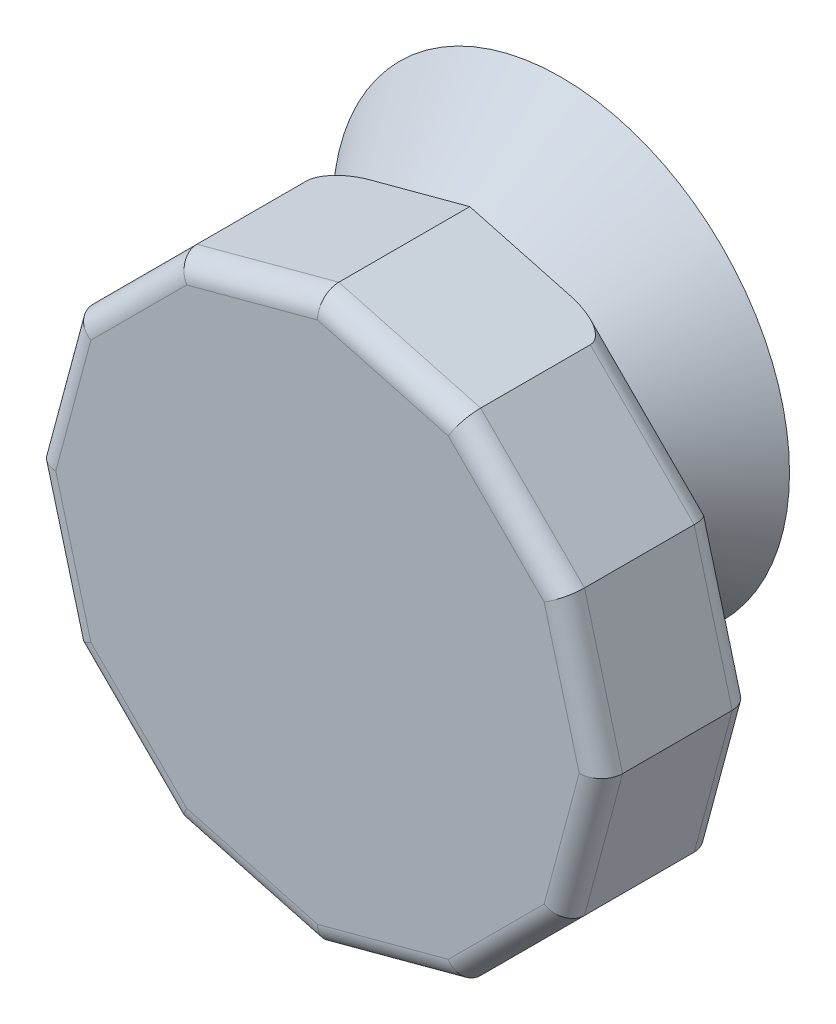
ISO-10303-21;
HEADER;
FILE_DESCRIPTION(('STEP AP214'),'2;1');
FILE_NAME('part.step','',(''),(''),'','','');
FILE_SCHEMA(('AUTOMOTIVE_DESIGN { 1 0 10303 214 1 1 1 1 }'));
ENDSEC;
DATA;
#1=APPLICATION_CONTEXT('core data for automotive mechanical design processes');
#2=APPLICATION_PROTOCOL_DEFINITION('international standard','automotive_design',2000,#1);
#3=PRODUCT_CONTEXT('',#1,'mechanical');
#4=PRODUCT('Part','Part','',(#3));
#5=PRODUCT_RELATED_PRODUCT_CATEGORY('part','',(#4));
#6=PRODUCT_DEFINITION_FORMATION('','',#4);
#7=PRODUCT_DEFINITION_CONTEXT('part definition',#1,'design');
#8=PRODUCT_DEFINITION('design','',#6,#7);
#9=PRODUCT_DEFINITION_SHAPE('','',#8);
#10=(LENGTH_UNIT() NAMED_UNIT(*) SI_UNIT(.MILLI.,.METRE.));
#11=(NAMED_UNIT(*) PLANE_ANGLE_UNIT() SI_UNIT($,.RADIAN.));
#12=(NAMED_UNIT(*) SI_UNIT($,.STERADIAN.) SOLID_ANGLE_UNIT());
#13=UNCERTAINTY_MEASURE_WITH_UNIT(LENGTH_MEASURE(1.E-05),#10,'distance_accuracy_value','');
#14=(GEOMETRIC_REPRESENTATION_CONTEXT(3) GLOBAL_UNCERTAINTY_ASSIGNED_CONTEXT((#13)) GLOBAL_UNIT_ASSIGNED_CONTEXT((#10,
#11,#12)) REPRESENTATION_CONTEXT('',''));
#15=CARTESIAN_POINT('',(0.,0.,0.));
#16=DIRECTION('',(0.,0.,1.));
#17=DIRECTION('',(1.,0.,0.));
#18=AXIS2_PLACEMENT_3D('',#15,#16,#17);
#19=CARTESIAN_POINT('',(-9.31748562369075,0.,5.));
#20=DIRECTION('',(0.965925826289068,0.258819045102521,0.));
#21=DIRECTION('',(-0.258819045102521,0.965925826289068,0.));
#22=AXIS2_PLACEMENT_3D('',#19,#20,#21);
#23=PLANE('',#22);
#24=DIRECTION('',(0.,0.,-1.));
#25=VECTOR('',#24,1.);
#26=CARTESIAN_POINT('',(-8.06917924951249,-4.65874281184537,5.));
#27=LINE('',#26,#25);
#28=CARTESIAN_POINT('',(-8.06917924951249,-4.65874281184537,4.3));
#29=VERTEX_POINT('',#28);
#30=CARTESIAN_POINT('',(-8.06917924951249,-4.65874281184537,0.7));
#31=VERTEX_POINT('',#30);
#32=EDGE_CURVE('E334',#29,#31,#27,.T.);
#33=ORIENTED_EDGE('',*,*,#32,.F.);
#34=DIRECTION('',(0.258819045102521,-0.965925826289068,0.));
#35=VECTOR('',#34,1.);
#36=CARTESIAN_POINT('',(-9.31748562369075,0.,4.3));
#37=LINE('',#36,#35);
#38=CARTESIAN_POINT('',(-9.31748562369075,0.,4.3));
#39=VERTEX_POINT('',#38);
#40=EDGE_CURVE('E542',#29,#39,#37,.F.);
#41=ORIENTED_EDGE('',*,*,#40,.T.);
#42=DIRECTION('',(0.,0.,-1.));
#43=VECTOR('',#42,1.);
#44=CARTESIAN_POINT('',(-9.31748562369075,0.,5.));
#45=LINE('',#44,#43);
#46=CARTESIAN_POINT('',(-9.31748562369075,0.,0.7));
#47=VERTEX_POINT('',#46);
#48=EDGE_CURVE('E345',#39,#47,#45,.T.);
#49=ORIENTED_EDGE('',*,*,#48,.T.);
#50=DIRECTION('',(0.258819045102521,-0.965925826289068,0.));
#51=VECTOR('',#50,1.);
#52=CARTESIAN_POINT('',(-9.31748562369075,0.,0.7));
#53=LINE('',#52,#51);
#54=EDGE_CURVE('E539',#47,#31,#53,.T.);
#55=ORIENTED_EDGE('',*,*,#54,.T.);
#56=EDGE_LOOP('',(#33,#41,#49,#55));
#57=FACE_BOUND('',#56,.T.);
#58=ADVANCED_FACE('F47',(#57),#23,.F.);
#59=CARTESIAN_POINT('',(-8.06917924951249,-4.65874281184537,5.));
#60=DIRECTION('',(0.707106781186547,0.707106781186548,0.));
#61=DIRECTION('',(-0.707106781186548,0.707106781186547,0.));
#62=AXIS2_PLACEMENT_3D('',#59,#60,#61);
#63=PLANE('',#62);
#64=DIRECTION('',(0.,0.,-1.));
#65=VECTOR('',#64,1.);
#66=CARTESIAN_POINT('',(-4.65874281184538,-8.06917924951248,5.));
#67=LINE('',#66,#65);
#68=CARTESIAN_POINT('',(-4.65874281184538,-8.06917924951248,4.3));
#69=VERTEX_POINT('',#68);
#70=CARTESIAN_POINT('',(-4.65874281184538,-8.06917924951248,0.7));
#71=VERTEX_POINT('',#70);
#72=EDGE_CURVE('E385',#69,#71,#67,.T.);
#73=ORIENTED_EDGE('',*,*,#72,.F.);
#74=DIRECTION('',(0.707106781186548,-0.707106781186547,0.));
#75=VECTOR('',#74,1.);
#76=CARTESIAN_POINT('',(-8.06917924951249,-4.65874281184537,4.3));
#77=LINE('',#76,#75);
#78=EDGE_CURVE('E536',#69,#29,#77,.F.);
#79=ORIENTED_EDGE('',*,*,#78,.T.);
#80=ORIENTED_EDGE('',*,*,#32,.T.);
#81=DIRECTION('',(0.707106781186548,-0.707106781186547,0.));
#82=VECTOR('',#81,1.);
#83=CARTESIAN_POINT('',(-8.06917924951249,-4.65874281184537,0.7));
#84=LINE('',#83,#82);
#85=EDGE_CURVE('E533',#31,#71,#84,.T.);
#86=ORIENTED_EDGE('',*,*,#85,.T.);
#87=EDGE_LOOP('',(#73,#79,#80,#86));
#88=FACE_BOUND('',#87,.T.);
#89=ADVANCED_FACE('F731',(#88),#63,.F.);
#90=CARTESIAN_POINT('',(-4.65874281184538,-8.06917924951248,5.));
#91=DIRECTION('',(0.258819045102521,0.965925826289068,0.));
#92=DIRECTION('',(-0.965925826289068,0.258819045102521,0.));
#93=AXIS2_PLACEMENT_3D('',#90,#91,#92);
#94=PLANE('',#93);
#95=DIRECTION('',(0.,0.,-1.));
#96=VECTOR('',#95,1.);
#97=CARTESIAN_POINT('',(0.,-9.31748562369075,5.));
#98=LINE('',#97,#96);
#99=CARTESIAN_POINT('',(0.,-9.31748562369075,4.3));
#100=VERTEX_POINT('',#99);
#101=CARTESIAN_POINT('',(0.,-9.31748562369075,0.7));
#102=VERTEX_POINT('',#101);
#103=EDGE_CURVE('E381',#100,#102,#98,.T.);
#104=ORIENTED_EDGE('',*,*,#103,.F.);
#105=DIRECTION('',(0.965925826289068,-0.258819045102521,0.));
#106=VECTOR('',#105,1.);
#107=CARTESIAN_POINT('',(-4.65874281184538,-8.06917924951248,4.3));
#108=LINE('',#107,#106);
#109=EDGE_CURVE('E530',#100,#69,#108,.F.);
#110=ORIENTED_EDGE('',*,*,#109,.T.);
#111=ORIENTED_EDGE('',*,*,#72,.T.);
#112=DIRECTION('',(0.965925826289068,-0.258819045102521,0.));
#113=VECTOR('',#112,1.);
#114=CARTESIAN_POINT('',(-4.65874281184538,-8.06917924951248,0.7));
#115=LINE('',#114,#113);
#116=EDGE_CURVE('E527',#71,#102,#115,.T.);
#117=ORIENTED_EDGE('',*,*,#116,.T.);
#118=EDGE_LOOP('',(#104,#110,#111,#117));
#119=FACE_BOUND('',#118,.T.);
#120=ADVANCED_FACE('F738',(#119),#94,.F.);
#121=CARTESIAN_POINT('',(0.,-9.31748562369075,5.));
#122=DIRECTION('',(-0.25881904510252,0.965925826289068,0.));
#123=DIRECTION('',(-0.965925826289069,-0.25881904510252,0.));
#124=AXIS2_PLACEMENT_3D('',#121,#122,#123);
#125=PLANE('',#124);
#126=DIRECTION('',(0.,0.,-1.));
#127=VECTOR('',#126,1.);
#128=CARTESIAN_POINT('',(4.65874281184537,-8.06917924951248,5.));
#129=LINE('',#128,#127);
#130=CARTESIAN_POINT('',(4.65874281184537,-8.06917924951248,4.3));
#131=VERTEX_POINT('',#130);
#132=CARTESIAN_POINT('',(4.65874281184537,-8.06917924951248,0.7));
#133=VERTEX_POINT('',#132);
#134=EDGE_CURVE('E377',#131,#133,#129,.T.);
#135=ORIENTED_EDGE('',*,*,#134,.F.);
#136=DIRECTION('',(0.965925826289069,0.25881904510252,0.));
#137=VECTOR('',#136,1.);
#138=CARTESIAN_POINT('',(0.,-9.31748562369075,4.3));
#139=LINE('',#138,#137);
#140=EDGE_CURVE('E524',#131,#100,#139,.F.);
#141=ORIENTED_EDGE('',*,*,#140,.T.);
#142=ORIENTED_EDGE('',*,*,#103,.T.);
#143=DIRECTION('',(0.965925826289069,0.25881904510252,0.));
#144=VECTOR('',#143,1.);
#145=CARTESIAN_POINT('',(0.,-9.31748562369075,0.7));
#146=LINE('',#145,#144);
#147=EDGE_CURVE('E521',#102,#133,#146,.T.);
#148=ORIENTED_EDGE('',*,*,#147,.T.);
#149=EDGE_LOOP('',(#135,#141,#142,#148));
#150=FACE_BOUND('',#149,.T.);
#151=ADVANCED_FACE('F1040',(#150),#125,.F.);
#152=CARTESIAN_POINT('',(4.65874281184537,-8.06917924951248,5.));
#153=DIRECTION('',(-0.707106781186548,0.707106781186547,0.));
#154=DIRECTION('',(-0.707106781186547,-0.707106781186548,0.));
#155=AXIS2_PLACEMENT_3D('',#152,#153,#154);
#156=PLANE('',#155);
#157=DIRECTION('',(0.,0.,-1.));
#158=VECTOR('',#157,1.);
#159=CARTESIAN_POINT('',(8.06917924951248,-4.65874281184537,5.));
#160=LINE('',#159,#158);
#161=CARTESIAN_POINT('',(8.06917924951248,-4.65874281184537,4.3));
#162=VERTEX_POINT('',#161);
#163=CARTESIAN_POINT('',(8.06917924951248,-4.65874281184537,0.7));
#164=VERTEX_POINT('',#163);
#165=EDGE_CURVE('E373',#162,#164,#160,.T.);
#166=ORIENTED_EDGE('',*,*,#165,.F.);
#167=DIRECTION('',(0.707106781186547,0.707106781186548,0.));
#168=VECTOR('',#167,1.);
#169=CARTESIAN_POINT('',(4.65874281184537,-8.06917924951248,4.3));
#170=LINE('',#169,#168);
#171=EDGE_CURVE('E518',#162,#131,#170,.F.);
#172=ORIENTED_EDGE('',*,*,#171,.T.);
#173=ORIENTED_EDGE('',*,*,#134,.T.);
#174=DIRECTION('',(0.707106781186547,0.707106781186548,0.));
#175=VECTOR('',#174,1.);
#176=CARTESIAN_POINT('',(4.65874281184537,-8.06917924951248,0.7));
#177=LINE('',#176,#175);
#178=EDGE_CURVE('E515',#133,#164,#177,.T.);
#179=ORIENTED_EDGE('',*,*,#178,.T.);
#180=EDGE_LOOP('',(#166,#172,#173,#179));
#181=FACE_BOUND('',#180,.T.);
#182=ADVANCED_FACE('F706',(#181),#156,.F.);
#183=CARTESIAN_POINT('',(8.06917924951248,-4.65874281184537,5.));
#184=DIRECTION('',(-0.965925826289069,0.25881904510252,0.));
#185=DIRECTION('',(-0.25881904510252,-0.965925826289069,0.));
#186=AXIS2_PLACEMENT_3D('',#183,#184,#185);
#187=PLANE('',#186);
#188=DIRECTION('',(0.,0.,-1.));
#189=VECTOR('',#188,1.);
#190=CARTESIAN_POINT('',(9.31748562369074,0.,5.));
#191=LINE('',#190,#189);
#192=CARTESIAN_POINT('',(9.31748562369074,0.,4.3));
#193=VERTEX_POINT('',#192);
#194=CARTESIAN_POINT('',(9.31748562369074,0.,0.7));
#195=VERTEX_POINT('',#194);
#196=EDGE_CURVE('E369',#193,#195,#191,.T.);
#197=ORIENTED_EDGE('',*,*,#196,.F.);
#198=DIRECTION('',(0.25881904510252,0.965925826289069,0.));
#199=VECTOR('',#198,1.);
#200=CARTESIAN_POINT('',(8.06917924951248,-4.65874281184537,4.3));
#201=LINE('',#200,#199);
#202=EDGE_CURVE('E512',#193,#162,#201,.F.);
#203=ORIENTED_EDGE('',*,*,#202,.T.);
#204=ORIENTED_EDGE('',*,*,#165,.T.);
#205=DIRECTION('',(0.25881904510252,0.965925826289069,0.));
#206=VECTOR('',#205,1.);
#207=CARTESIAN_POINT('',(8.06917924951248,-4.65874281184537,0.7));
#208=LINE('',#207,#206);
#209=EDGE_CURVE('E509',#164,#195,#208,.T.);
#210=ORIENTED_EDGE('',*,*,#209,.T.);
#211=EDGE_LOOP('',(#197,#203,#204,#210));
#212=FACE_BOUND('',#211,.T.);
#213=ADVANCED_FACE('F704',(#212),#187,.F.);
#214=CARTESIAN_POINT('',(9.31748562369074,0.,5.));
#215=DIRECTION('',(-0.965925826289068,-0.258819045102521,0.));
#216=DIRECTION('',(0.258819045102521,-0.965925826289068,0.));
#217=AXIS2_PLACEMENT_3D('',#214,#215,#216);
#218=PLANE('',#217);
#219=DIRECTION('',(0.,0.,-1.));
#220=VECTOR('',#219,1.);
#221=CARTESIAN_POINT('',(8.06917924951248,4.65874281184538,5.));
#222=LINE('',#221,#220);
#223=CARTESIAN_POINT('',(8.06917924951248,4.65874281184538,4.3));
#224=VERTEX_POINT('',#223);
#225=CARTESIAN_POINT('',(8.06917924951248,4.65874281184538,0.7));
#226=VERTEX_POINT('',#225);
#227=EDGE_CURVE('E365',#224,#226,#222,.T.);
#228=ORIENTED_EDGE('',*,*,#227,.F.);
#229=DIRECTION('',(-0.258819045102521,0.965925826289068,0.));
#230=VECTOR('',#229,1.);
#231=CARTESIAN_POINT('',(9.31748562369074,0.,4.3));
#232=LINE('',#231,#230);
#233=EDGE_CURVE('E506',#224,#193,#232,.F.);
#234=ORIENTED_EDGE('',*,*,#233,.T.);
#235=ORIENTED_EDGE('',*,*,#196,.T.);
#236=DIRECTION('',(-0.258819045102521,0.965925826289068,0.));
#237=VECTOR('',#236,1.);
#238=CARTESIAN_POINT('',(9.31748562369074,0.,0.7));
#239=LINE('',#238,#237);
#240=EDGE_CURVE('E503',#195,#226,#239,.T.);
#241=ORIENTED_EDGE('',*,*,#240,.T.);
#242=EDGE_LOOP('',(#228,#234,#235,#241));
#243=FACE_BOUND('',#242,.T.);
#244=ADVANCED_FACE('F691',(#243),#218,.F.);
#245=CARTESIAN_POINT('',(8.06917924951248,4.65874281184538,5.));
#246=DIRECTION('',(-0.707106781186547,-0.707106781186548,0.));
#247=DIRECTION('',(0.707106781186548,-0.707106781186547,0.));
#248=AXIS2_PLACEMENT_3D('',#245,#246,#247);
#249=PLANE('',#248);
#250=DIRECTION('',(0.,0.,-1.));
#251=VECTOR('',#250,1.);
#252=CARTESIAN_POINT('',(4.65874281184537,8.06917924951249,5.));
#253=LINE('',#252,#251);
#254=CARTESIAN_POINT('',(4.65874281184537,8.06917924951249,4.3));
#255=VERTEX_POINT('',#254);
#256=CARTESIAN_POINT('',(4.65874281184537,8.06917924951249,0.7));
#257=VERTEX_POINT('',#256);
#258=EDGE_CURVE('E361',#255,#257,#253,.T.);
#259=ORIENTED_EDGE('',*,*,#258,.F.);
#260=DIRECTION('',(-0.707106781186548,0.707106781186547,0.));
#261=VECTOR('',#260,1.);
#262=CARTESIAN_POINT('',(8.06917924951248,4.65874281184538,4.3));
#263=LINE('',#262,#261);
#264=EDGE_CURVE('E500',#255,#224,#263,.F.);
#265=ORIENTED_EDGE('',*,*,#264,.T.);
#266=ORIENTED_EDGE('',*,*,#227,.T.);
#267=DIRECTION('',(-0.707106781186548,0.707106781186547,0.));
#268=VECTOR('',#267,1.);
#269=CARTESIAN_POINT('',(8.06917924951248,4.65874281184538,0.7));
#270=LINE('',#269,#268);
#271=EDGE_CURVE('E497',#226,#257,#270,.T.);
#272=ORIENTED_EDGE('',*,*,#271,.T.);
#273=EDGE_LOOP('',(#259,#265,#266,#272));
#274=FACE_BOUND('',#273,.T.);
#275=ADVANCED_FACE('F662',(#274),#249,.F.);
#276=CARTESIAN_POINT('',(4.65874281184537,8.06917924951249,5.));
#277=DIRECTION('',(-0.25881904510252,-0.965925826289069,0.));
#278=DIRECTION('',(0.965925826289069,-0.25881904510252,0.));
#279=AXIS2_PLACEMENT_3D('',#276,#277,#278);
#280=PLANE('',#279);
#281=DIRECTION('',(0.,0.,-1.));
#282=VECTOR('',#281,1.);
#283=CARTESIAN_POINT('',(0.,9.31748562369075,5.));
#284=LINE('',#283,#282);
#285=CARTESIAN_POINT('',(0.,9.31748562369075,4.3));
#286=VERTEX_POINT('',#285);
#287=CARTESIAN_POINT('',(0.,9.31748562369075,0.));
#288=VERTEX_POINT('',#287);
#289=EDGE_CURVE('E357',#286,#288,#284,.T.);
#290=ORIENTED_EDGE('',*,*,#289,.F.);
#291=DIRECTION('',(-0.965925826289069,0.25881904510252,0.));
#292=VECTOR('',#291,1.);
#293=CARTESIAN_POINT('',(4.65874281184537,8.06917924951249,4.3));
#294=LINE('',#293,#292);
#295=EDGE_CURVE('E494',#286,#255,#294,.F.);
#296=ORIENTED_EDGE('',*,*,#295,.T.);
#297=ORIENTED_EDGE('',*,*,#258,.T.);
#298=CARTESIAN_POINT('',(3.30644665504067,8.43152591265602,0.7));
#299=DIRECTION('',(-0.25881904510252,-0.965925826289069,0.));
#300=DIRECTION('',(-0.965925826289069,0.25881904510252,0.));
#301=AXIS2_PLACEMENT_3D('',#298,#299,#300);
#302=ELLIPSE('',#301,1.4,0.7);
#303=CARTESIAN_POINT('',(3.30644665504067,8.43152591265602,0.));
#304=VERTEX_POINT('',#303);
#305=EDGE_CURVE('E491',#257,#304,#302,.F.);
#306=ORIENTED_EDGE('',*,*,#305,.T.);
#307=DIRECTION('',(-0.965925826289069,0.25881904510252,0.));
#308=VECTOR('',#307,1.);
#309=CARTESIAN_POINT('',(4.65874281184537,8.06917924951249,0.));
#310=LINE('',#309,#308);
#311=EDGE_CURVE('E338',#304,#288,#310,.T.);
#312=ORIENTED_EDGE('',*,*,#311,.T.);
#313=EDGE_LOOP('',(#290,#296,#297,#306,#312));
#314=FACE_BOUND('',#313,.T.);
#315=ADVANCED_FACE('F667',(#314),#280,.F.);
#316=CARTESIAN_POINT('',(0.,9.31748562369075,5.));
#317=DIRECTION('',(0.258819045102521,-0.965925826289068,0.));
#318=DIRECTION('',(0.965925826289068,0.258819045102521,0.));
#319=AXIS2_PLACEMENT_3D('',#316,#317,#318);
#320=PLANE('',#319);
#321=DIRECTION('',(0.,0.,-1.));
#322=VECTOR('',#321,1.);
#323=CARTESIAN_POINT('',(-4.65874281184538,8.06917924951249,5.));
#324=LINE('',#323,#322);
#325=CARTESIAN_POINT('',(-4.65874281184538,8.06917924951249,4.3));
#326=VERTEX_POINT('',#325);
#327=CARTESIAN_POINT('',(-4.65874281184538,8.06917924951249,0.7));
#328=VERTEX_POINT('',#327);
#329=EDGE_CURVE('E353',#326,#328,#324,.T.);
#330=ORIENTED_EDGE('',*,*,#329,.F.);
#331=DIRECTION('',(-0.965925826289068,-0.258819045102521,0.));
#332=VECTOR('',#331,1.);
#333=CARTESIAN_POINT('',(0.,9.31748562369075,4.3));
#334=LINE('',#333,#332);
#335=EDGE_CURVE('E488',#326,#286,#334,.F.);
#336=ORIENTED_EDGE('',*,*,#335,.T.);
#337=ORIENTED_EDGE('',*,*,#289,.T.);
#338=DIRECTION('',(-0.965925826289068,-0.258819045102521,0.));
#339=VECTOR('',#338,1.);
#340=CARTESIAN_POINT('',(0.,9.31748562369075,0.));
#341=LINE('',#340,#339);
#342=CARTESIAN_POINT('',(-3.30644665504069,8.43152591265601,0.));
#343=VERTEX_POINT('',#342);
#344=EDGE_CURVE('E341',#288,#343,#341,.T.);
#345=ORIENTED_EDGE('',*,*,#344,.T.);
#346=CARTESIAN_POINT('',(-3.30644665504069,8.43152591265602,0.7));
#347=DIRECTION('',(0.258819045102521,-0.965925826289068,0.));
#348=DIRECTION('',(-0.965925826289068,-0.258819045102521,0.));
#349=AXIS2_PLACEMENT_3D('',#346,#347,#348);
#350=ELLIPSE('',#349,1.4,0.7);
#351=EDGE_CURVE('E485',#343,#328,#350,.F.);
#352=ORIENTED_EDGE('',*,*,#351,.T.);
#353=EDGE_LOOP('',(#330,#336,#337,#345,#352));
#354=FACE_BOUND('',#353,.T.);
#355=ADVANCED_FACE('F995',(#354),#320,.F.);
#356=CARTESIAN_POINT('',(-4.65874281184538,8.06917924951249,5.));
#357=DIRECTION('',(0.707106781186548,-0.707106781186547,0.));
#358=DIRECTION('',(0.707106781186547,0.707106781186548,0.));
#359=AXIS2_PLACEMENT_3D('',#356,#357,#358);
#360=PLANE('',#359);
#361=DIRECTION('',(0.,0.,-1.));
#362=VECTOR('',#361,1.);
#363=CARTESIAN_POINT('',(-8.06917924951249,4.65874281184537,5.));
#364=LINE('',#363,#362);
#365=CARTESIAN_POINT('',(-8.06917924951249,4.65874281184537,4.3));
#366=VERTEX_POINT('',#365);
#367=CARTESIAN_POINT('',(-8.06917924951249,4.65874281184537,0.7));
#368=VERTEX_POINT('',#367);
#369=EDGE_CURVE('E349',#366,#368,#364,.T.);
#370=ORIENTED_EDGE('',*,*,#369,.F.);
#371=DIRECTION('',(-0.707106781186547,-0.707106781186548,0.));
#372=VECTOR('',#371,1.);
#373=CARTESIAN_POINT('',(-4.65874281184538,8.06917924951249,4.3));
#374=LINE('',#373,#372);
#375=EDGE_CURVE('E482',#366,#326,#374,.F.);
#376=ORIENTED_EDGE('',*,*,#375,.T.);
#377=ORIENTED_EDGE('',*,*,#329,.T.);
#378=DIRECTION('',(-0.707106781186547,-0.707106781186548,0.));
#379=VECTOR('',#378,1.);
#380=CARTESIAN_POINT('',(-4.65874281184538,8.06917924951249,0.7));
#381=LINE('',#380,#379);
#382=EDGE_CURVE('E478',#328,#368,#381,.T.);
#383=ORIENTED_EDGE('',*,*,#382,.T.);
#384=EDGE_LOOP('',(#370,#376,#377,#383));
#385=FACE_BOUND('',#384,.T.);
#386=ADVANCED_FACE('F986',(#385),#360,.F.);
#387=CARTESIAN_POINT('',(-8.06917924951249,4.65874281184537,5.));
#388=DIRECTION('',(0.965925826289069,-0.25881904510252,0.));
#389=DIRECTION('',(0.25881904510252,0.965925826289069,0.));
#390=AXIS2_PLACEMENT_3D('',#387,#388,#389);
#391=PLANE('',#390);
#392=ORIENTED_EDGE('',*,*,#48,.F.);
#393=DIRECTION('',(-0.25881904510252,-0.965925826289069,0.));
#394=VECTOR('',#393,1.);
#395=CARTESIAN_POINT('',(-8.06917924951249,4.65874281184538,4.3));
#396=LINE('',#395,#394);
#397=EDGE_CURVE('E474',#39,#366,#396,.F.);
#398=ORIENTED_EDGE('',*,*,#397,.T.);
#399=ORIENTED_EDGE('',*,*,#369,.T.);
#400=DIRECTION('',(-0.25881904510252,-0.965925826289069,0.));
#401=VECTOR('',#400,1.);
#402=CARTESIAN_POINT('',(-8.06917924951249,4.65874281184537,0.7));
#403=LINE('',#402,#401);
#404=EDGE_CURVE('E471',#368,#47,#403,.T.);
#405=ORIENTED_EDGE('',*,*,#404,.T.);
#406=EDGE_LOOP('',(#392,#398,#399,#405));
#407=FACE_BOUND('',#406,.T.);
#408=ADVANCED_FACE('F978',(#407),#391,.F.);
#409=CARTESIAN_POINT('',(0.,0.,5.));
#410=DIRECTION('',(0.,0.,1.));
#411=DIRECTION('',(1.,0.,0.));
#412=AXIS2_PLACEMENT_3D('',#409,#410,#411);
#413=PLANE('',#412);
#414=DIRECTION('',(-0.707106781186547,-0.707106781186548,0.));
#415=VECTOR('',#414,1.);
#416=CARTESIAN_POINT('',(-7.57420450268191,4.16376806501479,5.));
#417=LINE('',#416,#415);
#418=CARTESIAN_POINT('',(-4.29639614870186,7.44157641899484,5.));
#419=VERTEX_POINT('',#418);
#420=CARTESIAN_POINT('',(-7.44157641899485,4.29639614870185,5.));
#421=VERTEX_POINT('',#420);
#422=EDGE_CURVE('E464',#419,#421,#417,.T.);
#423=ORIENTED_EDGE('',*,*,#422,.T.);
#424=DIRECTION('',(-0.25881904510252,-0.965925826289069,0.));
#425=VECTOR('',#424,1.);
#426=CARTESIAN_POINT('',(-8.6413375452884,-0.181173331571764,5.));
#427=LINE('',#426,#425);
#428=CARTESIAN_POINT('',(-8.59279229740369,0.,5.));
#429=VERTEX_POINT('',#428);
#430=EDGE_CURVE('E467',#421,#429,#427,.T.);
#431=ORIENTED_EDGE('',*,*,#430,.T.);
#432=DIRECTION('',(0.258819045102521,-0.965925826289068,0.));
#433=VECTOR('',#432,1.);
#434=CARTESIAN_POINT('',(-7.39303117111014,-4.47756948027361,5.));
#435=LINE('',#434,#433);
#436=CARTESIAN_POINT('',(-7.44157641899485,-4.29639614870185,5.));
#437=VERTEX_POINT('',#436);
#438=EDGE_CURVE('E434',#429,#437,#435,.T.);
#439=ORIENTED_EDGE('',*,*,#438,.T.);
#440=DIRECTION('',(0.707106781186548,-0.707106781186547,0.));
#441=VECTOR('',#440,1.);
#442=CARTESIAN_POINT('',(-4.16376806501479,-7.5742045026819,5.));
#443=LINE('',#442,#441);
#444=CARTESIAN_POINT('',(-4.29639614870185,-7.44157641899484,5.));
#445=VERTEX_POINT('',#444);
#446=EDGE_CURVE('E437',#437,#445,#443,.T.);
#447=ORIENTED_EDGE('',*,*,#446,.T.);
#448=DIRECTION('',(0.965925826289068,-0.258819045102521,0.));
#449=VECTOR('',#448,1.);
#450=CARTESIAN_POINT('',(0.181173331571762,-8.6413375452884,5.));
#451=LINE('',#450,#449);
#452=CARTESIAN_POINT('',(0.,-8.59279229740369,5.));
#453=VERTEX_POINT('',#452);
#454=EDGE_CURVE('E440',#445,#453,#451,.T.);
#455=ORIENTED_EDGE('',*,*,#454,.T.);
#456=DIRECTION('',(0.965925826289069,0.25881904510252,0.));
#457=VECTOR('',#456,1.);
#458=CARTESIAN_POINT('',(4.47756948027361,-7.39303117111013,5.));
#459=LINE('',#458,#457);
#460=CARTESIAN_POINT('',(4.29639614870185,-7.44157641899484,5.));
#461=VERTEX_POINT('',#460);
#462=EDGE_CURVE('E443',#453,#461,#459,.T.);
#463=ORIENTED_EDGE('',*,*,#462,.T.);
#464=DIRECTION('',(0.707106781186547,0.707106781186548,0.));
#465=VECTOR('',#464,1.);
#466=CARTESIAN_POINT('',(7.5742045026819,-4.16376806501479,5.));
#467=LINE('',#466,#465);
#468=CARTESIAN_POINT('',(7.44157641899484,-4.29639614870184,5.));
#469=VERTEX_POINT('',#468);
#470=EDGE_CURVE('E446',#461,#469,#467,.T.);
#471=ORIENTED_EDGE('',*,*,#470,.T.);
#472=DIRECTION('',(0.25881904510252,0.965925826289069,0.));
#473=VECTOR('',#472,1.);
#474=CARTESIAN_POINT('',(8.6413375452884,0.181173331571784,5.));
#475=LINE('',#474,#473);
#476=CARTESIAN_POINT('',(8.59279229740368,0.,5.));
#477=VERTEX_POINT('',#476);
#478=EDGE_CURVE('E449',#469,#477,#475,.T.);
#479=ORIENTED_EDGE('',*,*,#478,.T.);
#480=DIRECTION('',(-0.258819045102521,0.965925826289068,0.));
#481=VECTOR('',#480,1.);
#482=CARTESIAN_POINT('',(7.39303117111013,4.47756948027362,5.));
#483=LINE('',#482,#481);
#484=CARTESIAN_POINT('',(7.44157641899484,4.29639614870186,5.));
#485=VERTEX_POINT('',#484);
#486=EDGE_CURVE('E452',#477,#485,#483,.T.);
#487=ORIENTED_EDGE('',*,*,#486,.T.);
#488=DIRECTION('',(-0.707106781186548,0.707106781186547,0.));
#489=VECTOR('',#488,1.);
#490=CARTESIAN_POINT('',(4.16376806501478,7.57420450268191,5.));
#491=LINE('',#490,#489);
#492=CARTESIAN_POINT('',(4.29639614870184,7.44157641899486,5.));
#493=VERTEX_POINT('',#492);
#494=EDGE_CURVE('E455',#485,#493,#491,.T.);
#495=ORIENTED_EDGE('',*,*,#494,.T.);
#496=DIRECTION('',(-0.965925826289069,0.25881904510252,0.));
#497=VECTOR('',#496,1.);
#498=CARTESIAN_POINT('',(-0.181173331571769,8.64133754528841,5.));
#499=LINE('',#498,#497);
#500=CARTESIAN_POINT('',(0.,8.5927922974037,5.));
#501=VERTEX_POINT('',#500);
#502=EDGE_CURVE('E458',#493,#501,#499,.T.);
#503=ORIENTED_EDGE('',*,*,#502,.T.);
#504=DIRECTION('',(-0.965925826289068,-0.258819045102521,0.));
#505=VECTOR('',#504,1.);
#506=CARTESIAN_POINT('',(-4.47756948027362,7.39303117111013,5.));
#507=LINE('',#506,#505);
#508=EDGE_CURVE('E461',#501,#419,#507,.T.);
#509=ORIENTED_EDGE('',*,*,#508,.T.);
#510=EDGE_LOOP('',(#423,#431,#439,#447,#455,#463,#471,#479,#487,#495,#503,#509));
#511=FACE_BOUND('',#510,.T.);
#512=ADVANCED_FACE('F682',(#511),#413,.T.);
#513=CARTESIAN_POINT('',(0.,0.,0.));
#514=DIRECTION('',(0.,0.,1.));
#515=DIRECTION('',(1.,0.,0.));
#516=AXIS2_PLACEMENT_3D('',#513,#514,#515);
#517=PLANE('',#516);
#518=CARTESIAN_POINT('',(0.,4.00000000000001,0.));
#519=DIRECTION('',(0.,0.,-1.));
#520=DIRECTION('',(-1.,0.,0.));
#521=AXIS2_PLACEMENT_3D('',#518,#519,#520);
#522=CIRCLE('',#521,5.);
#523=CARTESIAN_POINT('',(-4.4710190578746,1.76169962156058,0.));
#524=VERTEX_POINT('',#523);
#525=CARTESIAN_POINT('',(4.4710190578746,1.76169962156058,0.));
#526=VERTEX_POINT('',#525);
#527=EDGE_CURVE('E329',#524,#526,#522,.T.);
#528=ORIENTED_EDGE('',*,*,#527,.F.);
#529=DIRECTION('',(0.,-1.,0.));
#530=VECTOR('',#529,1.);
#531=CARTESIAN_POINT('',(-4.4710190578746,0.,0.));
#532=LINE('',#531,#530);
#533=CARTESIAN_POINT('',(-4.4710190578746,1.5289809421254,0.));
#534=VERTEX_POINT('',#533);
#535=EDGE_CURVE('E320',#524,#534,#532,.T.);
#536=ORIENTED_EDGE('',*,*,#535,.T.);
#537=DIRECTION('',(1.,0.,0.));
#538=VECTOR('',#537,1.);
#539=CARTESIAN_POINT('',(0.,1.5289809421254,0.));
#540=LINE('',#539,#538);
#541=CARTESIAN_POINT('',(-4.34673035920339,1.5289809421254,0.));
#542=VERTEX_POINT('',#541);
#543=EDGE_CURVE('E292',#534,#542,#540,.T.);
#544=ORIENTED_EDGE('',*,*,#543,.T.);
#545=CARTESIAN_POINT('',(4.34673035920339,1.5289809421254,0.));
#546=VERTEX_POINT('',#545);
#547=EDGE_CURVE('E333',#546,#542,#522,.T.);
#548=ORIENTED_EDGE('',*,*,#547,.F.);
#549=CARTESIAN_POINT('',(4.4710190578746,1.5289809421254,0.));
#550=VERTEX_POINT('',#549);
#551=EDGE_CURVE('E319',#546,#550,#540,.T.);
#552=ORIENTED_EDGE('',*,*,#551,.T.);
#553=DIRECTION('',(0.,1.,0.));
#554=VECTOR('',#553,1.);
#555=CARTESIAN_POINT('',(4.4710190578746,0.,0.));
#556=LINE('',#555,#554);
#557=EDGE_CURVE('E324',#550,#526,#556,.T.);
#558=ORIENTED_EDGE('',*,*,#557,.T.);
#559=EDGE_LOOP('',(#528,#536,#544,#548,#552,#558));
#560=FACE_BOUND('',#559,.T.);
#561=DIRECTION('',(-0.25881904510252,-0.965925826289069,0.));
#562=VECTOR('',#561,1.);
#563=CARTESIAN_POINT('',(-8.01718435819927,2.14819807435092,0.));
#564=LINE('',#563,#562);
#565=CARTESIAN_POINT('',(-8.59279229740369,0.,0.));
#566=VERTEX_POINT('',#565);
#567=CARTESIAN_POINT('',(-7.44157641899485,4.29639614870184,0.));
#568=VERTEX_POINT('',#567);
#569=EDGE_CURVE('E57',#566,#568,#564,.F.);
#570=ORIENTED_EDGE('',*,*,#569,.T.);
#571=DIRECTION('',(-0.707106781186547,-0.707106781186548,0.));
#572=VECTOR('',#571,1.);
#573=CARTESIAN_POINT('',(-5.86898628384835,5.86898628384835,0.));
#574=LINE('',#573,#572);
#575=EDGE_CURVE('E11',#568,#343,#574,.F.);
#576=ORIENTED_EDGE('',*,*,#575,.T.);
#577=ORIENTED_EDGE('',*,*,#344,.F.);
#578=ORIENTED_EDGE('',*,*,#311,.F.);
#579=DIRECTION('',(-0.707106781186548,0.707106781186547,0.));
#580=VECTOR('',#579,1.);
#581=CARTESIAN_POINT('',(5.86898628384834,5.86898628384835,0.));
#582=LINE('',#581,#580);
#583=CARTESIAN_POINT('',(7.44157641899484,4.29639614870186,0.));
#584=VERTEX_POINT('',#583);
#585=EDGE_CURVE('E545',#304,#584,#582,.F.);
#586=ORIENTED_EDGE('',*,*,#585,.T.);
#587=DIRECTION('',(-0.258819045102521,0.965925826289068,0.));
#588=VECTOR('',#587,1.);
#589=CARTESIAN_POINT('',(8.01718435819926,2.14819807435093,0.));
#590=LINE('',#589,#588);
#591=CARTESIAN_POINT('',(8.59279229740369,0.,0.));
#592=VERTEX_POINT('',#591);
#593=EDGE_CURVE('E548',#584,#592,#590,.F.);
#594=ORIENTED_EDGE('',*,*,#593,.T.);
#595=DIRECTION('',(0.25881904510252,0.965925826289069,0.));
#596=VECTOR('',#595,1.);
#597=CARTESIAN_POINT('',(8.01718435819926,-2.14819807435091,0.));
#598=LINE('',#597,#596);
#599=CARTESIAN_POINT('',(7.44157641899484,-4.29639614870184,0.));
#600=VERTEX_POINT('',#599);
#601=EDGE_CURVE('E551',#592,#600,#598,.F.);
#602=ORIENTED_EDGE('',*,*,#601,.T.);
#603=DIRECTION('',(0.707106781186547,0.707106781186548,0.));
#604=VECTOR('',#603,1.);
#605=CARTESIAN_POINT('',(5.86898628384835,-5.86898628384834,0.));
#606=LINE('',#605,#604);
#607=CARTESIAN_POINT('',(4.29639614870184,-7.44157641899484,0.));
#608=VERTEX_POINT('',#607);
#609=EDGE_CURVE('E554',#600,#608,#606,.F.);
#610=ORIENTED_EDGE('',*,*,#609,.T.);
#611=DIRECTION('',(0.965925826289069,0.25881904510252,0.));
#612=VECTOR('',#611,1.);
#613=CARTESIAN_POINT('',(2.14819807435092,-8.01718435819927,0.));
#614=LINE('',#613,#612);
#615=CARTESIAN_POINT('',(0.,-8.59279229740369,0.));
#616=VERTEX_POINT('',#615);
#617=EDGE_CURVE('E557',#608,#616,#614,.F.);
#618=ORIENTED_EDGE('',*,*,#617,.T.);
#619=DIRECTION('',(0.965925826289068,-0.258819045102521,0.));
#620=VECTOR('',#619,1.);
#621=CARTESIAN_POINT('',(-2.14819807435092,-8.01718435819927,0.));
#622=LINE('',#621,#620);
#623=CARTESIAN_POINT('',(-4.29639614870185,-7.44157641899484,0.));
#624=VERTEX_POINT('',#623);
#625=EDGE_CURVE('E560',#616,#624,#622,.F.);
#626=ORIENTED_EDGE('',*,*,#625,.T.);
#627=DIRECTION('',(0.707106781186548,-0.707106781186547,0.));
#628=VECTOR('',#627,1.);
#629=CARTESIAN_POINT('',(-5.86898628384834,-5.86898628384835,0.));
#630=LINE('',#629,#628);
#631=CARTESIAN_POINT('',(-7.44157641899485,-4.29639614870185,0.));
#632=VERTEX_POINT('',#631);
#633=EDGE_CURVE('E563',#624,#632,#630,.F.);
#634=ORIENTED_EDGE('',*,*,#633,.T.);
#635=DIRECTION('',(0.258819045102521,-0.965925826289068,0.));
#636=VECTOR('',#635,1.);
#637=CARTESIAN_POINT('',(-8.01718435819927,-2.14819807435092,0.));
#638=LINE('',#637,#636);
#639=EDGE_CURVE('E68',#632,#566,#638,.F.);
#640=ORIENTED_EDGE('',*,*,#639,.T.);
#641=EDGE_LOOP('',(#570,#576,#577,#578,#586,#594,#602,#610,#618,#626,#634,#640));
#642=FACE_BOUND('',#641,.T.);
#643=ADVANCED_FACE('F720',(#560,#642),#517,.F.);
#644=CARTESIAN_POINT('',(0.,4.00000000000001,-3.));
#645=DIRECTION('',(0.,0.,-1.));
#646=DIRECTION('',(-1.,0.,0.));
#647=AXIS2_PLACEMENT_3D('',#644,#645,#646);
#648=PLANE('',#647);
#649=DIRECTION('',(0.,-1.,0.));
#650=VECTOR('',#649,1.);
#651=CARTESIAN_POINT('',(5.,3.,-3.));
#652=LINE('',#651,#650);
#653=CARTESIAN_POINT('',(5.,3.,-3.));
#654=VERTEX_POINT('',#653);
#655=CARTESIAN_POINT('',(5.,1.,-3.));
#656=VERTEX_POINT('',#655);
#657=EDGE_CURVE('E276',#654,#656,#652,.T.);
#658=ORIENTED_EDGE('',*,*,#657,.F.);
#659=DIRECTION('',(1.,0.,0.));
#660=VECTOR('',#659,1.);
#661=CARTESIAN_POINT('',(5.,3.,-3.));
#662=LINE('',#661,#660);
#663=CARTESIAN_POINT('',(-5.,3.,-3.));
#664=VERTEX_POINT('',#663);
#665=EDGE_CURVE('E281',#664,#654,#662,.T.);
#666=ORIENTED_EDGE('',*,*,#665,.F.);
#667=DIRECTION('',(0.,1.,0.));
#668=VECTOR('',#667,1.);
#669=CARTESIAN_POINT('',(-5.,3.,-3.));
#670=LINE('',#669,#668);
#671=CARTESIAN_POINT('',(-5.,1.,-3.));
#672=VERTEX_POINT('',#671);
#673=EDGE_CURVE('E257',#672,#664,#670,.T.);
#674=ORIENTED_EDGE('',*,*,#673,.F.);
#675=DIRECTION('',(-1.,0.,0.));
#676=VECTOR('',#675,1.);
#677=CARTESIAN_POINT('',(5.,1.,-3.));
#678=LINE('',#677,#676);
#679=EDGE_CURVE('E269',#656,#672,#678,.T.);
#680=ORIENTED_EDGE('',*,*,#679,.F.);
#681=EDGE_LOOP('',(#658,#666,#674,#680));
#682=FACE_BOUND('',#681,.T.);
#683=CARTESIAN_POINT('',(0.,4.00000000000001,-3.));
#684=DIRECTION('',(0.,0.,-1.));
#685=DIRECTION('',(-1.,0.,0.));
#686=AXIS2_PLACEMENT_3D('',#683,#684,#685);
#687=CIRCLE('',#686,7.5);
#688=CARTESIAN_POINT('',(-7.5,4.00000000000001,-3.));
#689=VERTEX_POINT('',#688);
#690=EDGE_CURVE('E328',#689,#689,#687,.T.);
#691=ORIENTED_EDGE('',*,*,#690,.T.);
#692=EDGE_LOOP('',(#691));
#693=FACE_BOUND('',#692,.T.);
#694=ADVANCED_FACE('F278',(#682,#693),#648,.T.);
#695=CARTESIAN_POINT('',(0.,4.00000000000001,-3.));
#696=DIRECTION('',(0.,0.,-1.));
#697=DIRECTION('',(-1.,0.,0.));
#698=AXIS2_PLACEMENT_3D('',#695,#696,#697);
#699=CONICAL_SURFACE('',#698,7.5,0.694738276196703);
#700=CARTESIAN_POINT('',(4.56974998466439,0.9998,-0.559930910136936));
#701=CARTESIAN_POINT('',(4.56106822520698,1.06134499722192,-0.510694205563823));
#702=CARTESIAN_POINT('',(4.55247737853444,1.12332014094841,-0.461973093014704));
#703=CARTESIAN_POINT('',(4.53551278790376,1.24819719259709,-0.365762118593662));
#704=CARTESIAN_POINT('',(4.52713893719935,1.31109862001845,-0.318271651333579));
#705=CARTESIAN_POINT('',(4.51063420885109,1.43796113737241,-0.224668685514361));
#706=CARTESIAN_POINT('',(4.50250334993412,1.50192230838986,-0.178556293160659));
#707=CARTESIAN_POINT('',(4.48652193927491,1.63104279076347,-0.0879212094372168));
#708=CARTESIAN_POINT('',(4.47867153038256,1.69620268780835,-0.0433993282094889));
#709=CARTESIAN_POINT('',(4.47098379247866,1.76200149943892,0.000199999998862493));
#710=B_SPLINE_CURVE_WITH_KNOTS('',3,(#700,#701,#702,#703,#704,#705,#706,#707,#708,#709),
.UNSPECIFIED.,.F.,.F.,(4,2,2,2,4),(0.,0.23788209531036,0.475644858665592,0.713425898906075,
0.951326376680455),.UNSPECIFIED.);
#711=CARTESIAN_POINT('',(4.50322295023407,1.49677704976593,-0.182637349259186));
#712=VERTEX_POINT('',#711);
#713=EDGE_CURVE('E427',#712,#526,#710,.T.);
#714=ORIENTED_EDGE('',*,*,#713,.F.);
#715=CARTESIAN_POINT('',(4.34655869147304,1.52901620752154,0.000199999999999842));
#716=CARTESIAN_POINT('',(4.45589076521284,1.50654640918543,-0.127232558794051));
#717=CARTESIAN_POINT('',(4.56502691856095,1.48404804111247,-0.254827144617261));
#718=CARTESIAN_POINT('',(4.78290735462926,1.4389941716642,-0.510340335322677));
#719=CARTESIAN_POINT('',(4.89165163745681,1.41643867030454,-0.638258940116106));
#720=CARTESIAN_POINT('',(5.0002,1.39385459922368,-0.76633957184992));
#721=B_SPLINE_CURVE_WITH_KNOTS('',3,(#715,#716,#717,#718,#719,#720),.UNSPECIFIED.,.F.,.F.,(4,2,
4),(0.,0.508207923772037,1.01641570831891),.UNSPECIFIED.);
#722=EDGE_CURVE('E420',#546,#712,#721,.T.);
#723=ORIENTED_EDGE('',*,*,#722,.F.);
#724=ORIENTED_EDGE('',*,*,#547,.T.);
#725=CARTESIAN_POINT('',(-5.0002,1.39385459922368,-0.76633957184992));
#726=CARTESIAN_POINT('',(-4.89165163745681,1.41643867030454,-0.638258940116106));
#727=CARTESIAN_POINT('',(-4.78290735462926,1.4389941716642,-0.510340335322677));
#728=CARTESIAN_POINT('',(-4.56502691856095,1.48404804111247,-0.254827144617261));
#729=CARTESIAN_POINT('',(-4.45589076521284,1.50654640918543,-0.12723255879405));
#730=CARTESIAN_POINT('',(-4.34655869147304,1.52901620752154,0.000200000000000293));
#731=B_SPLINE_CURVE_WITH_KNOTS('',3,(#725,#726,#727,#728,#729,#730),.UNSPECIFIED.,.F.,.F.,(4,2,
4),(0.,0.508207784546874,1.01641570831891),.UNSPECIFIED.);
#732=CARTESIAN_POINT('',(-4.50322295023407,1.49677704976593,-0.182637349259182));
#733=VERTEX_POINT('',#732);
#734=EDGE_CURVE('E392',#733,#542,#731,.T.);
#735=ORIENTED_EDGE('',*,*,#734,.F.);
#736=CARTESIAN_POINT('',(-4.47098379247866,1.76200149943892,0.000199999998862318));
#737=CARTESIAN_POINT('',(-4.47867153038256,1.69620268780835,-0.0433993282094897));
#738=CARTESIAN_POINT('',(-4.48652193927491,1.63104279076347,-0.0879212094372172));
#739=CARTESIAN_POINT('',(-4.50250334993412,1.50192230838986,-0.178556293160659));
#740=CARTESIAN_POINT('',(-4.51063420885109,1.43796113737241,-0.22466868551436));
#741=CARTESIAN_POINT('',(-4.52713893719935,1.31109862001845,-0.318271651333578));
#742=CARTESIAN_POINT('',(-4.53551278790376,1.24819719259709,-0.365762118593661));
#743=CARTESIAN_POINT('',(-4.55247737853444,1.12332014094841,-0.461973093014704));
#744=CARTESIAN_POINT('',(-4.56106822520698,1.06134499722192,-0.510694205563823));
#745=CARTESIAN_POINT('',(-4.56974998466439,0.9998,-0.559930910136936));
#746=B_SPLINE_CURVE_WITH_KNOTS('',3,(#736,#737,#738,#739,#740,#741,#742,#743,#744,#745),
.UNSPECIFIED.,.F.,.F.,(4,2,2,2,4),(0.,0.237900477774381,0.475681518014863,0.713444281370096,
0.951326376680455),.UNSPECIFIED.);
#747=EDGE_CURVE('E260',#524,#733,#746,.T.);
#748=ORIENTED_EDGE('',*,*,#747,.F.);
#749=ORIENTED_EDGE('',*,*,#527,.T.);
#750=EDGE_LOOP('',(#714,#723,#724,#735,#748,#749));
#751=FACE_BOUND('',#750,.T.);
#752=ORIENTED_EDGE('',*,*,#690,.F.);
#753=EDGE_LOOP('',(#752));
#754=FACE_BOUND('',#753,.T.);
#755=ADVANCED_FACE('F407',(#751,#754),#699,.T.);
#756=CARTESIAN_POINT('',(5.,3.,-3.));
#757=DIRECTION('',(0.984807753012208,0.,0.173648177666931));
#758=DIRECTION('',(0.173648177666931,0.,-0.984807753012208));
#759=AXIS2_PLACEMENT_3D('',#756,#757,#758);
#760=PLANE('',#759);
#761=DIRECTION('',(0.171087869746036,-0.171087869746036,-0.970287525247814));
#762=VECTOR('',#761,1.);
#763=CARTESIAN_POINT('',(4.94145788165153,1.05854211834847,-2.6679911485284));
#764=LINE('',#763,#762);
#765=CARTESIAN_POINT('',(4.29469207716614,1.70530792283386,0.999999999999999));
#766=VERTEX_POINT('',#765);
#767=EDGE_CURVE('E265',#766,#550,#764,.T.);
#768=ORIENTED_EDGE('',*,*,#767,.F.);
#769=DIRECTION('',(0.,-1.,0.));
#770=VECTOR('',#769,1.);
#771=CARTESIAN_POINT('',(4.29469207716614,0.,0.999999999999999));
#772=LINE('',#771,#770);
#773=CARTESIAN_POINT('',(4.29469207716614,2.29469207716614,0.999999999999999));
#774=VERTEX_POINT('',#773);
#775=EDGE_CURVE('E285',#774,#766,#772,.T.);
#776=ORIENTED_EDGE('',*,*,#775,.F.);
#777=DIRECTION('',(0.171087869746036,0.171087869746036,-0.970287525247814));
#778=VECTOR('',#777,1.);
#779=CARTESIAN_POINT('',(5.,3.,-3.));
#780=LINE('',#779,#778);
#781=EDGE_CURVE('E289',#774,#654,#780,.T.);
#782=ORIENTED_EDGE('',*,*,#781,.T.);
#783=ORIENTED_EDGE('',*,*,#657,.T.);
#784=EDGE_CURVE('E272',#712,#656,#764,.T.);
#785=ORIENTED_EDGE('',*,*,#784,.F.);
#786=ORIENTED_EDGE('',*,*,#713,.T.);
#787=ORIENTED_EDGE('',*,*,#557,.F.);
#788=EDGE_LOOP('',(#768,#776,#782,#783,#785,#786,#787));
#789=FACE_BOUND('',#788,.T.);
#790=ADVANCED_FACE('F415',(#789),#760,.F.);
#791=CARTESIAN_POINT('',(-5.,3.,-3.));
#792=DIRECTION('',(-0.984807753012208,0.,0.173648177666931));
#793=DIRECTION('',(0.173648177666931,0.,0.984807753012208));
#794=AXIS2_PLACEMENT_3D('',#791,#792,#793);
#795=PLANE('',#794);
#796=ORIENTED_EDGE('',*,*,#747,.T.);
#797=DIRECTION('',(-0.171087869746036,-0.171087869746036,-0.970287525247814));
#798=VECTOR('',#797,1.);
#799=CARTESIAN_POINT('',(-4.70728940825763,1.29271059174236,-1.33995574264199));
#800=LINE('',#799,#798);
#801=EDGE_CURVE('E253',#733,#672,#800,.T.);
#802=ORIENTED_EDGE('',*,*,#801,.T.);
#803=ORIENTED_EDGE('',*,*,#673,.T.);
#804=DIRECTION('',(-0.171087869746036,0.171087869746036,-0.970287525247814));
#805=VECTOR('',#804,1.);
#806=CARTESIAN_POINT('',(-5.,3.,-3.));
#807=LINE('',#806,#805);
#808=CARTESIAN_POINT('',(-4.29469207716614,2.29469207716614,0.999999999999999));
#809=VERTEX_POINT('',#808);
#810=EDGE_CURVE('E293',#809,#664,#807,.T.);
#811=ORIENTED_EDGE('',*,*,#810,.F.);
#812=DIRECTION('',(0.,1.,0.));
#813=VECTOR('',#812,1.);
#814=CARTESIAN_POINT('',(-4.29469207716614,0.,0.999999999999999));
#815=LINE('',#814,#813);
#816=CARTESIAN_POINT('',(-4.29469207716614,1.70530792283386,0.999999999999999));
#817=VERTEX_POINT('',#816);
#818=EDGE_CURVE('E309',#817,#809,#815,.T.);
#819=ORIENTED_EDGE('',*,*,#818,.F.);
#820=EDGE_CURVE('E264',#817,#534,#800,.T.);
#821=ORIENTED_EDGE('',*,*,#820,.T.);
#822=ORIENTED_EDGE('',*,*,#535,.F.);
#823=EDGE_LOOP('',(#796,#802,#803,#811,#819,#821,#822));
#824=FACE_BOUND('',#823,.T.);
#825=ADVANCED_FACE('F255',(#824),#795,.F.);
#826=CARTESIAN_POINT('',(5.,1.,-3.));
#827=DIRECTION('',(0.,-0.984807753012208,0.173648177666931));
#828=DIRECTION('',(0.,-0.173648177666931,-0.984807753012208));
#829=AXIS2_PLACEMENT_3D('',#826,#827,#828);
#830=PLANE('',#829);
#831=ORIENTED_EDGE('',*,*,#722,.T.);
#832=ORIENTED_EDGE('',*,*,#784,.T.);
#833=ORIENTED_EDGE('',*,*,#679,.T.);
#834=ORIENTED_EDGE('',*,*,#801,.F.);
#835=ORIENTED_EDGE('',*,*,#734,.T.);
#836=ORIENTED_EDGE('',*,*,#543,.F.);
#837=ORIENTED_EDGE('',*,*,#820,.F.);
#838=DIRECTION('',(-1.,0.,0.));
#839=VECTOR('',#838,1.);
#840=CARTESIAN_POINT('',(0.,1.70530792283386,0.999999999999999));
#841=LINE('',#840,#839);
#842=EDGE_CURVE('E304',#766,#817,#841,.T.);
#843=ORIENTED_EDGE('',*,*,#842,.F.);
#844=ORIENTED_EDGE('',*,*,#767,.T.);
#845=ORIENTED_EDGE('',*,*,#551,.F.);
#846=EDGE_LOOP('',(#831,#832,#833,#834,#835,#836,#837,#843,#844,#845));
#847=FACE_BOUND('',#846,.T.);
#848=ADVANCED_FACE('F270',(#847),#830,.F.);
#849=CARTESIAN_POINT('',(5.,3.,-3.));
#850=DIRECTION('',(0.,0.984807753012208,0.173648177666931));
#851=DIRECTION('',(0.,-0.173648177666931,0.984807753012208));
#852=AXIS2_PLACEMENT_3D('',#849,#850,#851);
#853=PLANE('',#852);
#854=ORIENTED_EDGE('',*,*,#665,.T.);
#855=ORIENTED_EDGE('',*,*,#781,.F.);
#856=DIRECTION('',(1.,0.,0.));
#857=VECTOR('',#856,1.);
#858=CARTESIAN_POINT('',(0.,2.29469207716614,0.999999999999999));
#859=LINE('',#858,#857);
#860=EDGE_CURVE('E305',#809,#774,#859,.T.);
#861=ORIENTED_EDGE('',*,*,#860,.F.);
#862=ORIENTED_EDGE('',*,*,#810,.T.);
#863=EDGE_LOOP('',(#854,#855,#861,#862));
#864=FACE_BOUND('',#863,.T.);
#865=ADVANCED_FACE('F414',(#864),#853,.F.);
#866=CARTESIAN_POINT('',(0.,0.,0.999999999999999));
#867=DIRECTION('',(0.,0.,-1.));
#868=DIRECTION('',(-1.,0.,0.));
#869=AXIS2_PLACEMENT_3D('',#866,#867,#868);
#870=PLANE('',#869);
#871=ORIENTED_EDGE('',*,*,#775,.T.);
#872=ORIENTED_EDGE('',*,*,#842,.T.);
#873=ORIENTED_EDGE('',*,*,#818,.T.);
#874=ORIENTED_EDGE('',*,*,#860,.T.);
#875=EDGE_LOOP('',(#871,#872,#873,#874));
#876=FACE_BOUND('',#875,.T.);
#877=ADVANCED_FACE('F782',(#876),#870,.T.);
#878=CARTESIAN_POINT('',(8.01718435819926,-2.14819807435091,4.3));
#879=DIRECTION('',(-0.25881904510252,-0.965925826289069,0.));
#880=DIRECTION('',(0.965925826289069,-0.25881904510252,0.));
#881=AXIS2_PLACEMENT_3D('',#878,#879,#880);
#882=CYLINDRICAL_SURFACE('',#881,0.7);
#883=CARTESIAN_POINT('',(7.44157641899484,-4.29639614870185,4.3));
#884=DIRECTION('',(-0.499999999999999,-0.866025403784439,0.));
#885=DIRECTION('',(-0.866025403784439,0.499999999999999,0.));
#886=AXIS2_PLACEMENT_3D('',#883,#884,#885);
#887=ELLIPSE('',#886,0.724693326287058,0.7);
#888=EDGE_CURVE('E608',#162,#469,#887,.T.);
#889=ORIENTED_EDGE('',*,*,#888,.F.);
#890=ORIENTED_EDGE('',*,*,#202,.F.);
#891=CARTESIAN_POINT('',(8.59279229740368,0.,4.3));
#892=DIRECTION('',(0.,-1.,0.));
#893=DIRECTION('',(-1.,0.,0.));
#894=AXIS2_PLACEMENT_3D('',#891,#892,#893);
#895=ELLIPSE('',#894,0.724693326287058,0.7);
#896=EDGE_CURVE('E612',#477,#193,#895,.F.);
#897=ORIENTED_EDGE('',*,*,#896,.F.);
#898=ORIENTED_EDGE('',*,*,#478,.F.);
#899=EDGE_LOOP('',(#889,#890,#897,#898));
#900=FACE_BOUND('',#899,.T.);
#901=ADVANCED_FACE('F700',(#900),#882,.T.);
#902=CARTESIAN_POINT('',(8.01718435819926,2.14819807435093,4.3));
#903=DIRECTION('',(0.258819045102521,-0.965925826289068,0.));
#904=DIRECTION('',(0.965925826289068,0.258819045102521,0.));
#905=AXIS2_PLACEMENT_3D('',#902,#903,#904);
#906=CYLINDRICAL_SURFACE('',#905,0.7);
#907=ORIENTED_EDGE('',*,*,#896,.T.);
#908=ORIENTED_EDGE('',*,*,#233,.F.);
#909=CARTESIAN_POINT('',(7.44157641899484,4.29639614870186,4.3));
#910=DIRECTION('',(0.5,-0.866025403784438,0.));
#911=DIRECTION('',(-0.866025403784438,-0.500000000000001,0.));
#912=AXIS2_PLACEMENT_3D('',#909,#910,#911);
#913=ELLIPSE('',#912,0.724693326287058,0.7);
#914=EDGE_CURVE('E604',#485,#224,#913,.F.);
#915=ORIENTED_EDGE('',*,*,#914,.F.);
#916=ORIENTED_EDGE('',*,*,#486,.F.);
#917=EDGE_LOOP('',(#907,#908,#915,#916));
#918=FACE_BOUND('',#917,.T.);
#919=ADVANCED_FACE('F694',(#918),#906,.T.);
#920=CARTESIAN_POINT('',(5.86898628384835,-5.86898628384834,4.3));
#921=DIRECTION('',(-0.707106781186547,-0.707106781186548,0.));
#922=DIRECTION('',(0.707106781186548,-0.707106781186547,0.));
#923=AXIS2_PLACEMENT_3D('',#920,#921,#922);
#924=CYLINDRICAL_SURFACE('',#923,0.7);
#925=ORIENTED_EDGE('',*,*,#888,.T.);
#926=ORIENTED_EDGE('',*,*,#470,.F.);
#927=CARTESIAN_POINT('',(4.29639614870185,-7.44157641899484,4.3));
#928=DIRECTION('',(-0.866025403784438,-0.5,0.));
#929=DIRECTION('',(-0.500000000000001,0.866025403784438,0.));
#930=AXIS2_PLACEMENT_3D('',#927,#928,#929);
#931=ELLIPSE('',#930,0.724693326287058,0.7);
#932=EDGE_CURVE('E600',#131,#461,#931,.T.);
#933=ORIENTED_EDGE('',*,*,#932,.F.);
#934=ORIENTED_EDGE('',*,*,#171,.F.);
#935=EDGE_LOOP('',(#925,#926,#933,#934));
#936=FACE_BOUND('',#935,.T.);
#937=ADVANCED_FACE('F774',(#936),#924,.T.);
#938=CARTESIAN_POINT('',(5.86898628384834,5.86898628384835,4.3));
#939=DIRECTION('',(0.707106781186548,-0.707106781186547,0.));
#940=DIRECTION('',(0.707106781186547,0.707106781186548,0.));
#941=AXIS2_PLACEMENT_3D('',#938,#939,#940);
#942=CYLINDRICAL_SURFACE('',#941,0.7);
#943=ORIENTED_EDGE('',*,*,#914,.T.);
#944=ORIENTED_EDGE('',*,*,#264,.F.);
#945=CARTESIAN_POINT('',(4.29639614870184,7.44157641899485,4.3));
#946=DIRECTION('',(0.866025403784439,-0.499999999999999,0.));
#947=DIRECTION('',(-0.499999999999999,-0.866025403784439,0.));
#948=AXIS2_PLACEMENT_3D('',#945,#946,#947);
#949=ELLIPSE('',#948,0.724693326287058,0.7);
#950=EDGE_CURVE('E596',#493,#255,#949,.F.);
#951=ORIENTED_EDGE('',*,*,#950,.F.);
#952=ORIENTED_EDGE('',*,*,#494,.F.);
#953=EDGE_LOOP('',(#943,#944,#951,#952));
#954=FACE_BOUND('',#953,.T.);
#955=ADVANCED_FACE('F688',(#954),#942,.T.);
#956=CARTESIAN_POINT('',(2.14819807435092,-8.01718435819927,4.3));
#957=DIRECTION('',(-0.965925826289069,-0.25881904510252,0.));
#958=DIRECTION('',(0.25881904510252,-0.965925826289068,0.));
#959=AXIS2_PLACEMENT_3D('',#956,#957,#958);
#960=CYLINDRICAL_SURFACE('',#959,0.7);
#961=ORIENTED_EDGE('',*,*,#932,.T.);
#962=ORIENTED_EDGE('',*,*,#462,.F.);
#963=CARTESIAN_POINT('',(0.,-8.59279229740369,4.3));
#964=DIRECTION('',(-1.,0.,0.));
#965=DIRECTION('',(0.,1.,0.));
#966=AXIS2_PLACEMENT_3D('',#963,#964,#965);
#967=ELLIPSE('',#966,0.724693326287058,0.7);
#968=EDGE_CURVE('E592',#100,#453,#967,.T.);
#969=ORIENTED_EDGE('',*,*,#968,.F.);
#970=ORIENTED_EDGE('',*,*,#140,.F.);
#971=EDGE_LOOP('',(#961,#962,#969,#970));
#972=FACE_BOUND('',#971,.T.);
#973=ADVANCED_FACE('F768',(#972),#960,.T.);
#974=CARTESIAN_POINT('',(2.14819807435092,8.01718435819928,4.3));
#975=DIRECTION('',(0.965925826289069,-0.25881904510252,0.));
#976=DIRECTION('',(0.25881904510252,0.965925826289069,0.));
#977=AXIS2_PLACEMENT_3D('',#974,#975,#976);
#978=CYLINDRICAL_SURFACE('',#977,0.7);
#979=ORIENTED_EDGE('',*,*,#950,.T.);
#980=ORIENTED_EDGE('',*,*,#295,.F.);
#981=CARTESIAN_POINT('',(0.,8.59279229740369,4.3));
#982=DIRECTION('',(1.,0.,0.));
#983=DIRECTION('',(0.,-1.,0.));
#984=AXIS2_PLACEMENT_3D('',#981,#982,#983);
#985=ELLIPSE('',#984,0.724693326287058,0.7);
#986=EDGE_CURVE('E588',#501,#286,#985,.F.);
#987=ORIENTED_EDGE('',*,*,#986,.F.);
#988=ORIENTED_EDGE('',*,*,#502,.F.);
#989=EDGE_LOOP('',(#979,#980,#987,#988));
#990=FACE_BOUND('',#989,.T.);
#991=ADVANCED_FACE('F672',(#990),#978,.T.);
#992=CARTESIAN_POINT('',(-2.14819807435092,-8.01718435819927,4.3));
#993=DIRECTION('',(-0.965925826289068,0.258819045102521,0.));
#994=DIRECTION('',(-0.258819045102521,-0.965925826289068,0.));
#995=AXIS2_PLACEMENT_3D('',#992,#993,#994);
#996=CYLINDRICAL_SURFACE('',#995,0.7);
#997=ORIENTED_EDGE('',*,*,#968,.T.);
#998=ORIENTED_EDGE('',*,*,#454,.F.);
#999=CARTESIAN_POINT('',(-4.29639614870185,-7.44157641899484,4.3));
#1000=DIRECTION('',(-0.866025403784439,0.5,0.));
#1001=DIRECTION('',(0.5,0.866025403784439,0.));
#1002=AXIS2_PLACEMENT_3D('',#999,#1000,#1001);
#1003=ELLIPSE('',#1002,0.724693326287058,0.7);
#1004=EDGE_CURVE('E584',#69,#445,#1003,.T.);
#1005=ORIENTED_EDGE('',*,*,#1004,.F.);
#1006=ORIENTED_EDGE('',*,*,#109,.F.);
#1007=EDGE_LOOP('',(#997,#998,#1005,#1006));
#1008=FACE_BOUND('',#1007,.T.);
#1009=ADVANCED_FACE('F762',(#1008),#996,.T.);
#1010=CARTESIAN_POINT('',(-2.14819807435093,8.01718435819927,4.3));
#1011=DIRECTION('',(0.965925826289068,0.258819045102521,0.));
#1012=DIRECTION('',(-0.258819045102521,0.965925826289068,0.));
#1013=AXIS2_PLACEMENT_3D('',#1010,#1011,#1012);
#1014=CYLINDRICAL_SURFACE('',#1013,0.7);
#1015=ORIENTED_EDGE('',*,*,#986,.T.);
#1016=ORIENTED_EDGE('',*,*,#335,.F.);
#1017=CARTESIAN_POINT('',(-4.29639614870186,7.44157641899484,4.3));
#1018=DIRECTION('',(0.866025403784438,0.5,0.));
#1019=DIRECTION('',(0.500000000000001,-0.866025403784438,0.));
#1020=AXIS2_PLACEMENT_3D('',#1017,#1018,#1019);
#1021=ELLIPSE('',#1020,0.724693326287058,0.7);
#1022=EDGE_CURVE('E580',#419,#326,#1021,.F.);
#1023=ORIENTED_EDGE('',*,*,#1022,.F.);
#1024=ORIENTED_EDGE('',*,*,#508,.F.);
#1025=EDGE_LOOP('',(#1015,#1016,#1023,#1024));
#1026=FACE_BOUND('',#1025,.T.);
#1027=ADVANCED_FACE('F678',(#1026),#1014,.T.);
#1028=CARTESIAN_POINT('',(-5.86898628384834,-5.86898628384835,4.3));
#1029=DIRECTION('',(-0.707106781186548,0.707106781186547,0.));
#1030=DIRECTION('',(-0.707106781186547,-0.707106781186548,0.));
#1031=AXIS2_PLACEMENT_3D('',#1028,#1029,#1030);
#1032=CYLINDRICAL_SURFACE('',#1031,0.7);
#1033=ORIENTED_EDGE('',*,*,#1004,.T.);
#1034=ORIENTED_EDGE('',*,*,#446,.F.);
#1035=CARTESIAN_POINT('',(-7.44157641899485,-4.29639614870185,4.3));
#1036=DIRECTION('',(-0.5,0.866025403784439,0.));
#1037=DIRECTION('',(0.866025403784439,0.5,0.));
#1038=AXIS2_PLACEMENT_3D('',#1035,#1036,#1037);
#1039=ELLIPSE('',#1038,0.724693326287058,0.7);
#1040=EDGE_CURVE('E576',#29,#437,#1039,.T.);
#1041=ORIENTED_EDGE('',*,*,#1040,.F.);
#1042=ORIENTED_EDGE('',*,*,#78,.F.);
#1043=EDGE_LOOP('',(#1033,#1034,#1041,#1042));
#1044=FACE_BOUND('',#1043,.T.);
#1045=ADVANCED_FACE('F755',(#1044),#1032,.T.);
#1046=CARTESIAN_POINT('',(-5.86898628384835,5.86898628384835,4.3));
#1047=DIRECTION('',(0.707106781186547,0.707106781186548,0.));
#1048=DIRECTION('',(-0.707106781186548,0.707106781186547,0.));
#1049=AXIS2_PLACEMENT_3D('',#1046,#1047,#1048);
#1050=CYLINDRICAL_SURFACE('',#1049,0.7);
#1051=ORIENTED_EDGE('',*,*,#1022,.T.);
#1052=ORIENTED_EDGE('',*,*,#375,.F.);
#1053=CARTESIAN_POINT('',(-7.44157641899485,4.29639614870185,4.3));
#1054=DIRECTION('',(0.499999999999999,0.866025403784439,0.));
#1055=DIRECTION('',(0.866025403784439,-0.499999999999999,0.));
#1056=AXIS2_PLACEMENT_3D('',#1053,#1054,#1055);
#1057=ELLIPSE('',#1056,0.724693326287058,0.7);
#1058=EDGE_CURVE('E573',#421,#366,#1057,.F.);
#1059=ORIENTED_EDGE('',*,*,#1058,.F.);
#1060=ORIENTED_EDGE('',*,*,#422,.F.);
#1061=EDGE_LOOP('',(#1051,#1052,#1059,#1060));
#1062=FACE_BOUND('',#1061,.T.);
#1063=ADVANCED_FACE('F751',(#1062),#1050,.T.);
#1064=CARTESIAN_POINT('',(-8.01718435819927,-2.14819807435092,4.3));
#1065=DIRECTION('',(-0.258819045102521,0.965925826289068,0.));
#1066=DIRECTION('',(-0.965925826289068,-0.258819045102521,0.));
#1067=AXIS2_PLACEMENT_3D('',#1064,#1065,#1066);
#1068=CYLINDRICAL_SURFACE('',#1067,0.7);
#1069=ORIENTED_EDGE('',*,*,#1040,.T.);
#1070=ORIENTED_EDGE('',*,*,#438,.F.);
#1071=CARTESIAN_POINT('',(-8.59279229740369,0.,4.3));
#1072=DIRECTION('',(0.,1.,0.));
#1073=DIRECTION('',(-1.,0.,0.));
#1074=AXIS2_PLACEMENT_3D('',#1071,#1072,#1073);
#1075=ELLIPSE('',#1074,0.724693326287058,0.7);
#1076=EDGE_CURVE('E570',#39,#429,#1075,.T.);
#1077=ORIENTED_EDGE('',*,*,#1076,.F.);
#1078=ORIENTED_EDGE('',*,*,#40,.F.);
#1079=EDGE_LOOP('',(#1069,#1070,#1077,#1078));
#1080=FACE_BOUND('',#1079,.T.);
#1081=ADVANCED_FACE('F747',(#1080),#1068,.T.);
#1082=CARTESIAN_POINT('',(-8.01718435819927,2.14819807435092,4.3));
#1083=DIRECTION('',(0.25881904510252,0.965925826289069,0.));
#1084=DIRECTION('',(-0.965925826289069,0.25881904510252,0.));
#1085=AXIS2_PLACEMENT_3D('',#1082,#1083,#1084);
#1086=CYLINDRICAL_SURFACE('',#1085,0.7);
#1087=ORIENTED_EDGE('',*,*,#1058,.T.);
#1088=ORIENTED_EDGE('',*,*,#397,.F.);
#1089=ORIENTED_EDGE('',*,*,#1076,.T.);
#1090=ORIENTED_EDGE('',*,*,#430,.F.);
#1091=EDGE_LOOP('',(#1087,#1088,#1089,#1090));
#1092=FACE_BOUND('',#1091,.T.);
#1093=ADVANCED_FACE('F744',(#1092),#1086,.T.);
#1094=CARTESIAN_POINT('',(7.5742045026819,4.1637680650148,0.7));
#1095=DIRECTION('',(-0.707106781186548,0.707106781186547,0.));
#1096=DIRECTION('',(-0.707106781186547,-0.707106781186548,0.));
#1097=AXIS2_PLACEMENT_3D('',#1094,#1095,#1096);
#1098=CYLINDRICAL_SURFACE('',#1097,0.7);
#1099=ORIENTED_EDGE('',*,*,#305,.F.);
#1100=ORIENTED_EDGE('',*,*,#271,.F.);
#1101=CARTESIAN_POINT('',(7.44157641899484,4.29639614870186,0.7));
#1102=DIRECTION('',(-0.5,0.866025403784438,0.));
#1103=DIRECTION('',(-0.866025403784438,-0.500000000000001,0.));
#1104=AXIS2_PLACEMENT_3D('',#1101,#1102,#1103);
#1105=ELLIPSE('',#1104,0.724693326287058,0.7);
#1106=EDGE_CURVE('E51',#584,#226,#1105,.F.);
#1107=ORIENTED_EDGE('',*,*,#1106,.F.);
#1108=ORIENTED_EDGE('',*,*,#585,.F.);
#1109=EDGE_LOOP('',(#1099,#1100,#1107,#1108));
#1110=FACE_BOUND('',#1109,.T.);
#1111=ADVANCED_FACE('F49',(#1110),#1098,.T.);
#1112=CARTESIAN_POINT('',(8.6413375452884,-0.181173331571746,0.7));
#1113=DIRECTION('',(-0.258819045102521,0.965925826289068,0.));
#1114=DIRECTION('',(-0.965925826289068,-0.258819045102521,0.));
#1115=AXIS2_PLACEMENT_3D('',#1112,#1113,#1114);
#1116=CYLINDRICAL_SURFACE('',#1115,0.7);
#1117=ORIENTED_EDGE('',*,*,#1106,.T.);
#1118=ORIENTED_EDGE('',*,*,#240,.F.);
#1119=CARTESIAN_POINT('',(8.59279229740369,0.,0.7));
#1120=DIRECTION('',(0.,1.,0.));
#1121=DIRECTION('',(-1.,0.,0.));
#1122=AXIS2_PLACEMENT_3D('',#1119,#1120,#1121);
#1123=ELLIPSE('',#1122,0.724693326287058,0.7);
#1124=EDGE_CURVE('E642',#592,#195,#1123,.F.);
#1125=ORIENTED_EDGE('',*,*,#1124,.F.);
#1126=ORIENTED_EDGE('',*,*,#593,.F.);
#1127=EDGE_LOOP('',(#1117,#1118,#1125,#1126));
#1128=FACE_BOUND('',#1127,.T.);
#1129=ADVANCED_FACE('F655',(#1128),#1116,.T.);
#1130=CARTESIAN_POINT('',(7.39303117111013,-4.47756948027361,0.7));
#1131=DIRECTION('',(0.25881904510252,0.965925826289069,0.));
#1132=DIRECTION('',(-0.965925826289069,0.25881904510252,0.));
#1133=AXIS2_PLACEMENT_3D('',#1130,#1131,#1132);
#1134=CYLINDRICAL_SURFACE('',#1133,0.7);
#1135=ORIENTED_EDGE('',*,*,#1124,.T.);
#1136=ORIENTED_EDGE('',*,*,#209,.F.);
#1137=CARTESIAN_POINT('',(7.44157641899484,-4.29639614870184,0.7));
#1138=DIRECTION('',(0.499999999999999,0.866025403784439,0.));
#1139=DIRECTION('',(-0.866025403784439,0.499999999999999,0.));
#1140=AXIS2_PLACEMENT_3D('',#1137,#1138,#1139);
#1141=ELLIPSE('',#1140,0.724693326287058,0.7);
#1142=EDGE_CURVE('E639',#600,#164,#1141,.F.);
#1143=ORIENTED_EDGE('',*,*,#1142,.F.);
#1144=ORIENTED_EDGE('',*,*,#601,.F.);
#1145=EDGE_LOOP('',(#1135,#1136,#1143,#1144));
#1146=FACE_BOUND('',#1145,.T.);
#1147=ADVANCED_FACE('F722',(#1146),#1134,.T.);
#1148=CARTESIAN_POINT('',(4.16376806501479,-7.5742045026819,0.7));
#1149=DIRECTION('',(0.707106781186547,0.707106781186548,0.));
#1150=DIRECTION('',(-0.707106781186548,0.707106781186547,0.));
#1151=AXIS2_PLACEMENT_3D('',#1148,#1149,#1150);
#1152=CYLINDRICAL_SURFACE('',#1151,0.7);
#1153=ORIENTED_EDGE('',*,*,#1142,.T.);
#1154=ORIENTED_EDGE('',*,*,#178,.F.);
#1155=CARTESIAN_POINT('',(4.29639614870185,-7.44157641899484,0.7));
#1156=DIRECTION('',(0.866025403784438,0.5,0.));
#1157=DIRECTION('',(-0.500000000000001,0.866025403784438,0.));
#1158=AXIS2_PLACEMENT_3D('',#1155,#1156,#1157);
#1159=ELLIPSE('',#1158,0.724693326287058,0.7);
#1160=EDGE_CURVE('E635',#608,#133,#1159,.F.);
#1161=ORIENTED_EDGE('',*,*,#1160,.F.);
#1162=ORIENTED_EDGE('',*,*,#609,.F.);
#1163=EDGE_LOOP('',(#1153,#1154,#1161,#1162));
#1164=FACE_BOUND('',#1163,.T.);
#1165=ADVANCED_FACE('F711',(#1164),#1152,.T.);
#1166=CARTESIAN_POINT('',(-0.181173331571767,-8.6413375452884,0.7));
#1167=DIRECTION('',(0.965925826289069,0.25881904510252,0.));
#1168=DIRECTION('',(-0.25881904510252,0.965925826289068,0.));
#1169=AXIS2_PLACEMENT_3D('',#1166,#1167,#1168);
#1170=CYLINDRICAL_SURFACE('',#1169,0.7);
#1171=ORIENTED_EDGE('',*,*,#1160,.T.);
#1172=ORIENTED_EDGE('',*,*,#147,.F.);
#1173=CARTESIAN_POINT('',(0.,-8.59279229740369,0.7));
#1174=DIRECTION('',(1.,0.,0.));
#1175=DIRECTION('',(0.,1.,0.));
#1176=AXIS2_PLACEMENT_3D('',#1173,#1174,#1175);
#1177=ELLIPSE('',#1176,0.724693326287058,0.7);
#1178=EDGE_CURVE('E631',#616,#102,#1177,.F.);
#1179=ORIENTED_EDGE('',*,*,#1178,.F.);
#1180=ORIENTED_EDGE('',*,*,#617,.F.);
#1181=EDGE_LOOP('',(#1171,#1172,#1179,#1180));
#1182=FACE_BOUND('',#1181,.T.);
#1183=ADVANCED_FACE('F717',(#1182),#1170,.T.);
#1184=CARTESIAN_POINT('',(-4.47756948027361,-7.39303117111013,0.7));
#1185=DIRECTION('',(0.965925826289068,-0.258819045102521,0.));
#1186=DIRECTION('',(0.258819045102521,0.965925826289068,0.));
#1187=AXIS2_PLACEMENT_3D('',#1184,#1185,#1186);
#1188=CYLINDRICAL_SURFACE('',#1187,0.7);
#1189=ORIENTED_EDGE('',*,*,#1178,.T.);
#1190=ORIENTED_EDGE('',*,*,#116,.F.);
#1191=CARTESIAN_POINT('',(-4.29639614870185,-7.44157641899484,0.7));
#1192=DIRECTION('',(0.866025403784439,-0.5,0.));
#1193=DIRECTION('',(0.5,0.866025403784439,0.));
#1194=AXIS2_PLACEMENT_3D('',#1191,#1192,#1193);
#1195=ELLIPSE('',#1194,0.724693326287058,0.7);
#1196=EDGE_CURVE('E627',#624,#71,#1195,.F.);
#1197=ORIENTED_EDGE('',*,*,#1196,.F.);
#1198=ORIENTED_EDGE('',*,*,#625,.F.);
#1199=EDGE_LOOP('',(#1189,#1190,#1197,#1198));
#1200=FACE_BOUND('',#1199,.T.);
#1201=ADVANCED_FACE('F798',(#1200),#1188,.T.);
#1202=CARTESIAN_POINT('',(-7.5742045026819,-4.16376806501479,0.7));
#1203=DIRECTION('',(0.707106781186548,-0.707106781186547,0.));
#1204=DIRECTION('',(0.707106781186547,0.707106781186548,0.));
#1205=AXIS2_PLACEMENT_3D('',#1202,#1203,#1204);
#1206=CYLINDRICAL_SURFACE('',#1205,0.7);
#1207=ORIENTED_EDGE('',*,*,#1196,.T.);
#1208=ORIENTED_EDGE('',*,*,#85,.F.);
#1209=CARTESIAN_POINT('',(-7.44157641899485,-4.29639614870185,0.7));
#1210=DIRECTION('',(0.5,-0.866025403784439,0.));
#1211=DIRECTION('',(0.866025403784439,0.5,0.));
#1212=AXIS2_PLACEMENT_3D('',#1209,#1210,#1211);
#1213=ELLIPSE('',#1212,0.724693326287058,0.7);
#1214=EDGE_CURVE('E623',#632,#31,#1213,.F.);
#1215=ORIENTED_EDGE('',*,*,#1214,.F.);
#1216=ORIENTED_EDGE('',*,*,#633,.F.);
#1217=EDGE_LOOP('',(#1207,#1208,#1215,#1216));
#1218=FACE_BOUND('',#1217,.T.);
#1219=ADVANCED_FACE('F794',(#1218),#1206,.T.);
#1220=CARTESIAN_POINT('',(-8.6413375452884,0.181173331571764,0.7));
#1221=DIRECTION('',(0.258819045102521,-0.965925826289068,0.));
#1222=DIRECTION('',(0.965925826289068,0.258819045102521,0.));
#1223=AXIS2_PLACEMENT_3D('',#1220,#1221,#1222);
#1224=CYLINDRICAL_SURFACE('',#1223,0.7);
#1225=ORIENTED_EDGE('',*,*,#1214,.T.);
#1226=ORIENTED_EDGE('',*,*,#54,.F.);
#1227=CARTESIAN_POINT('',(-8.59279229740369,0.,0.7));
#1228=DIRECTION('',(0.,-1.,0.));
#1229=DIRECTION('',(1.,0.,0.));
#1230=AXIS2_PLACEMENT_3D('',#1227,#1228,#1229);
#1231=ELLIPSE('',#1230,0.724693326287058,0.7);
#1232=EDGE_CURVE('E619',#566,#47,#1231,.F.);
#1233=ORIENTED_EDGE('',*,*,#1232,.F.);
#1234=ORIENTED_EDGE('',*,*,#639,.F.);
#1235=EDGE_LOOP('',(#1225,#1226,#1233,#1234));
#1236=FACE_BOUND('',#1235,.T.);
#1237=ADVANCED_FACE('F790',(#1236),#1224,.T.);
#1238=CARTESIAN_POINT('',(-7.39303117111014,4.47756948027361,0.7));
#1239=DIRECTION('',(-0.25881904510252,-0.965925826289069,0.));
#1240=DIRECTION('',(0.965925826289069,-0.25881904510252,0.));
#1241=AXIS2_PLACEMENT_3D('',#1238,#1239,#1240);
#1242=CYLINDRICAL_SURFACE('',#1241,0.7);
#1243=ORIENTED_EDGE('',*,*,#1232,.T.);
#1244=ORIENTED_EDGE('',*,*,#404,.F.);
#1245=CARTESIAN_POINT('',(-7.44157641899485,4.29639614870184,0.7));
#1246=DIRECTION('',(-0.499999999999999,-0.866025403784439,0.));
#1247=DIRECTION('',(0.866025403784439,-0.499999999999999,0.));
#1248=AXIS2_PLACEMENT_3D('',#1245,#1246,#1247);
#1249=ELLIPSE('',#1248,0.724693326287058,0.7);
#1250=EDGE_CURVE('E616',#568,#368,#1249,.F.);
#1251=ORIENTED_EDGE('',*,*,#1250,.F.);
#1252=ORIENTED_EDGE('',*,*,#569,.F.);
#1253=EDGE_LOOP('',(#1243,#1244,#1251,#1252));
#1254=FACE_BOUND('',#1253,.T.);
#1255=ADVANCED_FACE('F786',(#1254),#1242,.T.);
#1256=CARTESIAN_POINT('',(-4.1637680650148,7.5742045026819,0.7));
#1257=DIRECTION('',(-0.707106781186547,-0.707106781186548,0.));
#1258=DIRECTION('',(0.707106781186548,-0.707106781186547,0.));
#1259=AXIS2_PLACEMENT_3D('',#1256,#1257,#1258);
#1260=CYLINDRICAL_SURFACE('',#1259,0.7);
#1261=ORIENTED_EDGE('',*,*,#351,.F.);
#1262=ORIENTED_EDGE('',*,*,#575,.F.);
#1263=ORIENTED_EDGE('',*,*,#1250,.T.);
#1264=ORIENTED_EDGE('',*,*,#382,.F.);
#1265=EDGE_LOOP('',(#1261,#1262,#1263,#1264));
#1266=FACE_BOUND('',#1265,.T.);
#1267=ADVANCED_FACE('F783',(#1266),#1260,.T.);
#1268=CLOSED_SHELL('',(#58,#89,#120,#151,#182,#213,#244,#275,#315,#355,#386,#408,#512,#643,#694,
#755,#790,#825,#848,#865,#877,#901,#919,#937,#955,#973,#991,#1009,#1027,#1045,#1063,#1081,#1093,
#1111,#1129,#1147,#1165,#1183,#1201,#1219,#1237,#1255,#1267));
#1269=MANIFOLD_SOLID_BREP('B2',#1268);
#1270=ADVANCED_BREP_SHAPE_REPRESENTATION('',(#18,#1269),#14);
#1271=SHAPE_DEFINITION_REPRESENTATION(#9,#1270);
ENDSEC;
END-ISO-10303-21;
